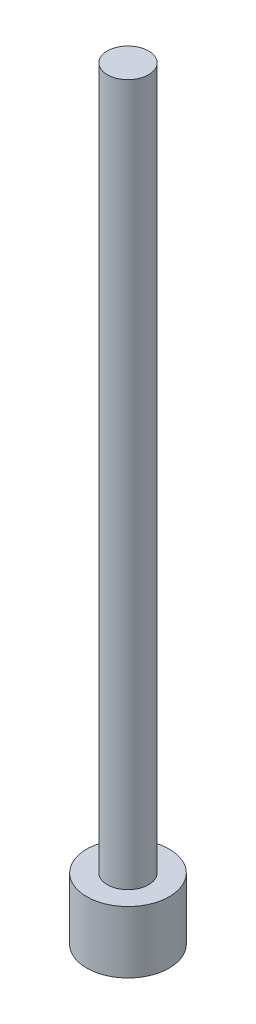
ISO-10303-21;
HEADER;
FILE_DESCRIPTION(('STEP AP214'),'2;1');
FILE_NAME('part.step','',(''),(''),'','','');
FILE_SCHEMA(('AUTOMOTIVE_DESIGN { 1 0 10303 214 1 1 1 1 }'));
ENDSEC;
DATA;
#1=APPLICATION_CONTEXT('core data for automotive mechanical design processes');
#2=APPLICATION_PROTOCOL_DEFINITION('international standard','automotive_design',2000,#1);
#3=PRODUCT_CONTEXT('',#1,'mechanical');
#4=PRODUCT('Part','Part','',(#3));
#5=PRODUCT_RELATED_PRODUCT_CATEGORY('part','',(#4));
#6=PRODUCT_DEFINITION_FORMATION('','',#4);
#7=PRODUCT_DEFINITION_CONTEXT('part definition',#1,'design');
#8=PRODUCT_DEFINITION('design','',#6,#7);
#9=PRODUCT_DEFINITION_SHAPE('','',#8);
#10=(LENGTH_UNIT() NAMED_UNIT(*) SI_UNIT(.MILLI.,.METRE.));
#11=(NAMED_UNIT(*) PLANE_ANGLE_UNIT() SI_UNIT($,.RADIAN.));
#12=(NAMED_UNIT(*) SI_UNIT($,.STERADIAN.) SOLID_ANGLE_UNIT());
#13=UNCERTAINTY_MEASURE_WITH_UNIT(LENGTH_MEASURE(1.E-05),#10,'distance_accuracy_value','');
#14=(GEOMETRIC_REPRESENTATION_CONTEXT(3) GLOBAL_UNCERTAINTY_ASSIGNED_CONTEXT((#13)) GLOBAL_UNIT_ASSIGNED_CONTEXT((#10,
#11,#12)) REPRESENTATION_CONTEXT('',''));
#15=CARTESIAN_POINT('',(0.,0.,0.));
#16=DIRECTION('',(0.,0.,1.));
#17=DIRECTION('',(1.,0.,0.));
#18=AXIS2_PLACEMENT_3D('',#15,#16,#17);
#19=CARTESIAN_POINT('',(0.,3.,0.));
#20=DIRECTION('',(0.,1.,0.));
#21=DIRECTION('',(0.,0.,1.));
#22=AXIS2_PLACEMENT_3D('',#19,#20,#21);
#23=PLANE('',#22);
#24=CARTESIAN_POINT('',(0.,3.,0.));
#25=DIRECTION('',(0.,1.,0.));
#26=DIRECTION('',(0.,0.,1.));
#27=AXIS2_PLACEMENT_3D('',#24,#25,#26);
#28=CIRCLE('',#27,2.);
#29=CARTESIAN_POINT('',(0.,3.,2.));
#30=VERTEX_POINT('',#29);
#31=EDGE_CURVE('E10',#30,#30,#28,.T.);
#32=ORIENTED_EDGE('',*,*,#31,.T.);
#33=EDGE_LOOP('',(#32));
#34=FACE_BOUND('',#33,.T.);
#35=CARTESIAN_POINT('',(0.,3.,0.));
#36=DIRECTION('',(0.,1.,0.));
#37=DIRECTION('',(0.,0.,1.));
#38=AXIS2_PLACEMENT_3D('',#35,#36,#37);
#39=CIRCLE('',#38,1.);
#40=CARTESIAN_POINT('',(0.,3.,1.));
#41=VERTEX_POINT('',#40);
#42=EDGE_CURVE('E45',#41,#41,#39,.T.);
#43=ORIENTED_EDGE('',*,*,#42,.F.);
#44=EDGE_LOOP('',(#43));
#45=FACE_BOUND('',#44,.T.);
#46=ADVANCED_FACE('F30',(#34,#45),#23,.T.);
#47=CARTESIAN_POINT('',(0.,3.,0.));
#48=DIRECTION('',(0.,-1.,0.));
#49=DIRECTION('',(0.,0.,-1.));
#50=AXIS2_PLACEMENT_3D('',#47,#48,#49);
#51=CYLINDRICAL_SURFACE('',#50,2.);
#52=ORIENTED_EDGE('',*,*,#31,.F.);
#53=EDGE_LOOP('',(#52));
#54=FACE_BOUND('',#53,.T.);
#55=CARTESIAN_POINT('',(0.,0.,0.));
#56=DIRECTION('',(0.,1.,0.));
#57=DIRECTION('',(0.,0.,1.));
#58=AXIS2_PLACEMENT_3D('',#55,#56,#57);
#59=CIRCLE('',#58,2.);
#60=CARTESIAN_POINT('',(0.,0.,2.));
#61=VERTEX_POINT('',#60);
#62=EDGE_CURVE('E37',#61,#61,#59,.T.);
#63=ORIENTED_EDGE('',*,*,#62,.T.);
#64=EDGE_LOOP('',(#63));
#65=FACE_BOUND('',#64,.T.);
#66=ADVANCED_FACE('F32',(#54,#65),#51,.T.);
#67=CARTESIAN_POINT('',(0.,0.,0.));
#68=DIRECTION('',(0.,1.,0.));
#69=DIRECTION('',(0.,0.,1.));
#70=AXIS2_PLACEMENT_3D('',#67,#68,#69);
#71=PLANE('',#70);
#72=ORIENTED_EDGE('',*,*,#62,.F.);
#73=EDGE_LOOP('',(#72));
#74=FACE_BOUND('',#73,.T.);
#75=ADVANCED_FACE('F57',(#74),#71,.F.);
#76=CARTESIAN_POINT('',(0.,37.,0.));
#77=DIRECTION('',(0.,-1.,0.));
#78=DIRECTION('',(0.,0.,-1.));
#79=AXIS2_PLACEMENT_3D('',#76,#77,#78);
#80=CYLINDRICAL_SURFACE('',#79,1.);
#81=CARTESIAN_POINT('',(0.,37.,0.));
#82=DIRECTION('',(0.,1.,0.));
#83=DIRECTION('',(0.,0.,1.));
#84=AXIS2_PLACEMENT_3D('',#81,#82,#83);
#85=CIRCLE('',#84,1.);
#86=CARTESIAN_POINT('',(0.,37.,1.));
#87=VERTEX_POINT('',#86);
#88=EDGE_CURVE('E41',#87,#87,#85,.T.);
#89=ORIENTED_EDGE('',*,*,#88,.F.);
#90=EDGE_LOOP('',(#89));
#91=FACE_BOUND('',#90,.T.);
#92=ORIENTED_EDGE('',*,*,#42,.T.);
#93=EDGE_LOOP('',(#92));
#94=FACE_BOUND('',#93,.T.);
#95=ADVANCED_FACE('F51',(#91,#94),#80,.T.);
#96=CARTESIAN_POINT('',(0.,37.,0.));
#97=DIRECTION('',(0.,1.,0.));
#98=DIRECTION('',(0.,0.,1.));
#99=AXIS2_PLACEMENT_3D('',#96,#97,#98);
#100=PLANE('',#99);
#101=ORIENTED_EDGE('',*,*,#88,.T.);
#102=EDGE_LOOP('',(#101));
#103=FACE_BOUND('',#102,.T.);
#104=ADVANCED_FACE('F65',(#103),#100,.T.);
#105=CLOSED_SHELL('',(#46,#66,#75,#95,#104));
#106=MANIFOLD_SOLID_BREP('B2',#105);
#107=ADVANCED_BREP_SHAPE_REPRESENTATION('',(#18,#106),#14);
#108=SHAPE_DEFINITION_REPRESENTATION(#9,#107);
ENDSEC;
END-ISO-10303-21;
